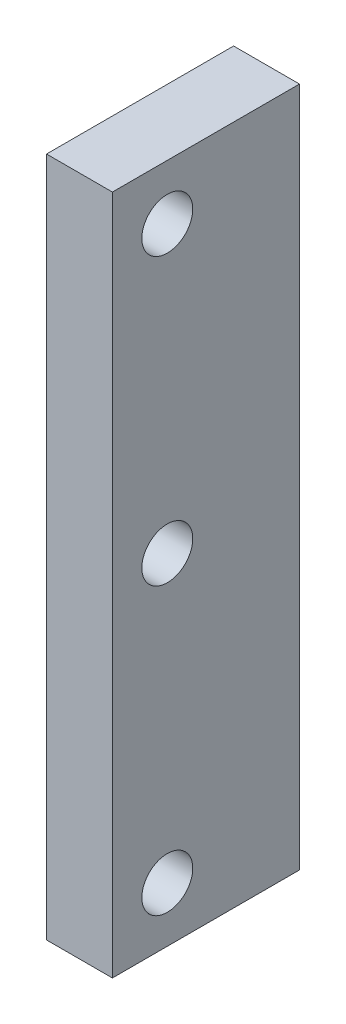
from build123d import *

# Parameters (mm, degrees)
SKETCH1_W                   = 3.81
SKETCH1_H                   = 10.8204
EXTRUDE1_DEPTH              = 39.37
F_32_0_116_DIAMETER_HOLE1_D = 2.9464
LPATTERN1_COUNT             = 3
LPATTERN1_PITCH             = 16.51


with BuildPart() as part:
    # Sketch1 → Extrude1 (new body)
    with BuildSketch(Plane(origin=(0, 0, 0), x_dir=(1, 0, 0), z_dir=(0, 1, 0))):
        with Locations((1.905, 5.4102)):
            Rectangle(SKETCH1_W, SKETCH1_H)
    extrude(amount=EXTRUDE1_DEPTH)

    # 32 _0.116_ Diameter Hole1 (through all)
    with Locations(Plane.ZY):
        with Locations((-3.175, 3.175)):
            f_32_0_116_diameter_hole1 = Hole(F_32_0_116_DIAMETER_HOLE1_D / 2)

    # LPattern1: 32 _0.116_ Diameter Hole1 ×3
    with Locations(*[(0, i * LPATTERN1_PITCH, 0) for i in range(1, LPATTERN1_COUNT)]):
        add(f_32_0_116_diameter_hole1, mode=Mode.SUBTRACT)


solid = part.part
